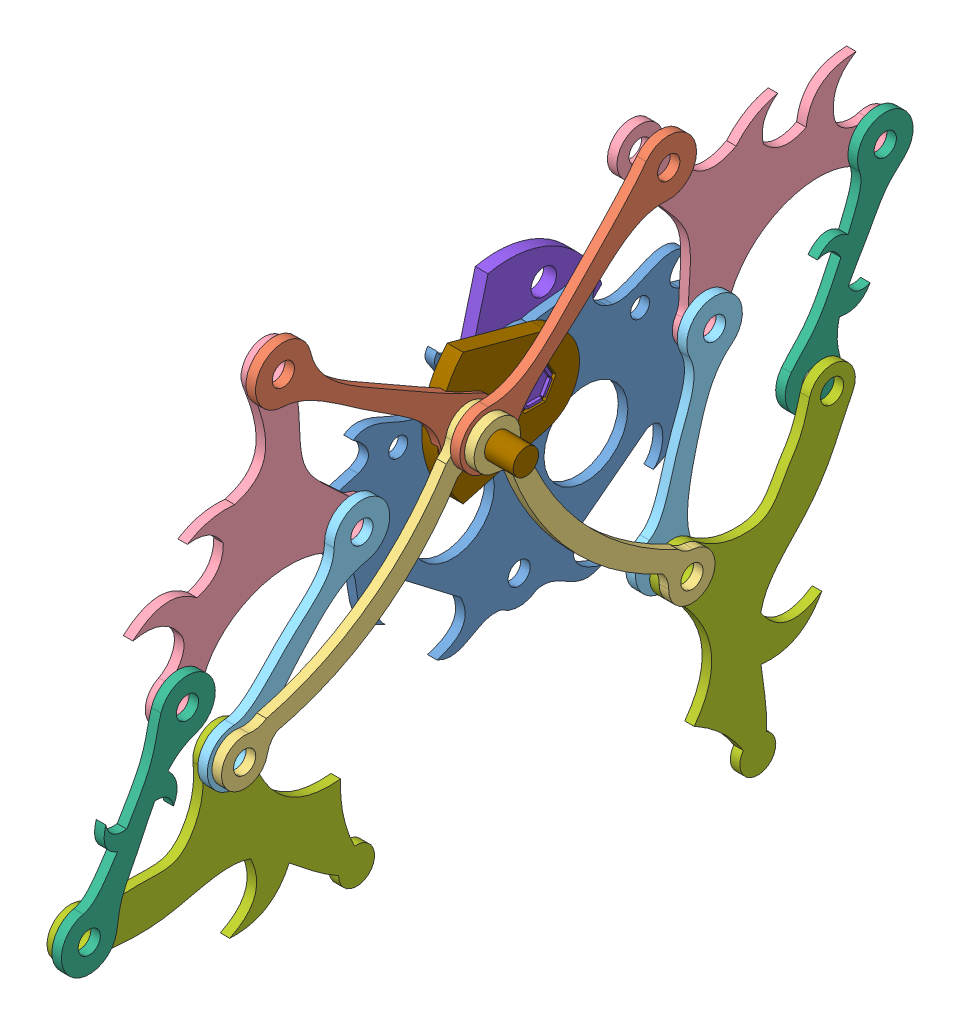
SolidWorks assembly Leg Pair.SLDASM, configuration Default (file format 7000). Lengths in mm.
Overall size (31.2 211.78 291.63).
15 component instances, 11 part files, 35 mates.
Components (placement in the parent):
- Body Plasma-1: Body Plasma.SLDPRT [Default] at (-1.2178 14.3874 -0.9979) size (3 86.21 128.33)
- Top Link Plasma-1: Top Link Plasma.SLDPRT [Default] at (3.8562 19.5324 42.9639) x (1 0 0) z (0 0.111578 0.993756) size (3 54.6 80.27)
- Top Link Plasma-2: Top Link Plasma.SLDPRT [Default] at (9.8562 49.7033 -38.2362) x (1 0 0) z (0 -0.935441 0.353482) size (3 54.6 80.27)
- Bottom Link Right Plasma-1: Bottom Link Right Plasma.SLDPRT [Default] at (2.6731 -6.268 62.766) x (1 0 0) z (0 -0.343411 -0.939185) size (3 89.15 65.46)
- Bottom Link Right Plasma-2: Bottom Link Right Plasma.SLDPRT [Default] at (8.6731 -1.4984 -1.689) x (1 0 0) z (0 -0.974254 0.225451) size (3 89.15 65.46)
- Shoulder Plasma-1: Shoulder Plasma.SLDPRT [Default] at (-3.4206 41.867 32.6126) x (1 0 0) z (0 -0.575566 0.817756) size (3 73.98 82.73)
- Shoulder Plasma-2: Shoulder Plasma.SLDPRT [Default] at (5.871 19.6041 -22.8253) x (-1 0 0) z (0 0.150403 -0.988625) size (3 73.98 82.73)
- Calf Plasma-1: Calf Plasma.SLDPRT [Default] at (3.818 -25.844 46.7531) x (1 0 0) z (0 0.928855 0.370443) size (3 69.77 41)
- Calf Plasma-2: Calf Plasma.SLDPRT [Default] at (3.818 -17.4657 -82.7015) x (1 0 0) z (0 0.649911 0.760011) size (3 69.77 41)
- Shin Plasma-1: Shin Plasma.SLDPRT [Default] at (4.0934 -85.1069 89.0539) x (1 0 0) z (0 0.895203 0.445658) size (3 66.73 47.12)
- Shin Plasma-2: Shin Plasma.SLDPRT [Default] at (4.357 15.3283 -165.5657) x (-1 0 0) z (0 -0.135116 0.99083) size (3 66.73 47.12)
- Foot Plasma-1: Foot Plasma.SLDPRT [Default] at (-4.6498 5.9095 107.7496) x (1 0 0) z (0 -0.773509 0.633785) size (3 95.59 65)
- Foot Plasma-2: Foot Plasma.SLDPRT [Default] at (16.1002 -11.5563 -20.4201) x (-1 0 0) z (0 0.153148 -0.988203) size (3 95.59 65)
- 3D Crank 3-1: 3D Crank 3.SLDPRT [Default] at (-7.4748 34.7385 -5.2038) x (1 0 0) z (0 0.866025 -0.5) size (12.2 41.31 44.62)
- 3D Crank End 3-1: 3D Crank End 3.SLDPRT [Default] at (-0.2748 27.4526 -0.9973) size (24 41.31 44.62)
Mates (geometry in assembly coordinates):
- Concentric2: concentric anti-aligned: cylinder of Top Link Plasma-1 through (5.7252 71.3273 79.1223) axis (-1 0 0) radius 3.5; cylinder of Shoulder Plasma-1 through (2.7252 71.3273 79.1223) axis (1 0 0) radius 3.5
- Concentric3: concentric anti-aligned: cylinder of Shoulder Plasma-1 through (2.7252 16.0776 54.4194) axis (1 0 0) radius 3.5; cylinder of Calf Plasma-1 through (5.7252 16.0776 54.4194) axis (-1 0 0) radius 3.5
- Concentric4: concentric anti-aligned: cylinder of Shoulder Plasma-1 through (2.7252 -4.2668 109.2457) axis (1 0 0) radius 3.5; cylinder of Shin Plasma-1 through (5.7252 -4.2668 109.2457) axis (-1 0 0) radius 3.5
- Concentric5: concentric anti-aligned: cylinder of Shin Plasma-1 through (5.7252 -52.7275 140.1167) axis (-1 0 0) radius 3.5; cylinder of Foot Plasma-1 through (2.7252 -52.7275 140.1167) axis (1 0 0) radius 3.6458
- Concentric6: concentric anti-aligned: cylinder of Calf Plasma-1 through (5.7252 -25.1127 94.2702) axis (-1 0 0) radius 3.5; cylinder of Foot Plasma-1 through (2.7252 -25.1127 94.2702) axis (1 0 0) radius 3.6458
- Concentric7: concentric anti-aligned: cylinder of Body Plasma-1 through (-3.2748 16.0776 54.4194) axis (-1 0 0) radius 3.5; cylinder of Shoulder Plasma-1 through (2.7252 16.0776 54.4194) axis (1 0 0) radius 3.5
- Concentric10: concentric aligned: cylinder of Bottom Link Right Plasma-1 through (8.7252 -25.1127 94.2702) axis (1 0 0) radius 3.5; cylinder of Foot Plasma-1 through (2.7252 -25.1127 94.2702) axis (1 0 0) radius 3.6458
- Concentric11: concentric aligned: cylinder of Top Link Plasma-1 through (2.7252 27.4526 20.8827) axis (1 0 0) radius 3.5; cylinder of Bottom Link Right Plasma-1 through (8.7252 27.4526 20.8827) axis (1 0 0) radius 3.5
- Coincident1: coincident anti-aligned: plane of Body Plasma-1 through (-0.2748 16.0776 -0.9973) normal (1 0 0); plane of Shoulder Plasma-1 through (-0.2748 47.9735 9.1021) normal (-1 0 0)
- Coincident2: coincident anti-aligned: plane of Shoulder Plasma-1 through (2.7252 47.9735 9.1021) normal (1 0 0); plane of Calf Plasma-1 through (2.7252 -35.3965 33.8907) normal (-1 0 0)
- Coincident3: coincident anti-aligned: plane of Shoulder Plasma-1 through (2.7252 47.9735 9.1021) normal (1 0 0); plane of Shin Plasma-1 through (2.7252 -111.1433 72.7055) normal (-1 0 0)
- Coincident4: coincident anti-aligned: plane of Top Link Plasma-1 through (2.7252 7.4102 42.2058) normal (-1 0 0); plane of Shoulder Plasma-1 through (2.7252 47.9735 9.1021) normal (1 0 0)
- Coincident5: coincident anti-aligned: plane of Calf Plasma-1 through (2.7252 -35.3965 33.8907) normal (-1 0 0); plane of Foot Plasma-1 through (2.7252 32.7077 114.4748) normal (1 0 0)
- Coincident6: coincident anti-aligned: plane of Bottom Link Right Plasma-1 through (5.7252 -10.6812 68.8124) normal (-1 0 0); plane of Calf Plasma-1 through (5.7252 -35.3965 33.8907) normal (1 0 0)
- Concentric12: concentric aligned: cylinder of Body Plasma-1 through (-3.2748 16.0776 -56.4139) axis (-1 0 0) radius 3.5; cylinder of Shoulder Plasma-2 through (-0.2748 16.0776 -56.4139) axis (-1 0 0) radius 3.5
- Coincident7: coincident anti-aligned: plane of Body Plasma-1 through (-0.2748 16.0776 -0.9973) normal (1 0 0); plane of Shoulder Plasma-2 through (-0.2748 7.7427 -1.6276) normal (-1 0 0)
- Concentric13: concentric aligned: cylinder of Shoulder Plasma-2 through (-0.2748 16.0776 -56.4139) axis (-1 0 0) radius 3.5; cylinder of Calf Plasma-2 through (5.7252 16.0776 -56.4139) axis (-1 0 0) radius 3.5
- Coincident8: coincident anti-aligned: plane of Shoulder Plasma-2 through (2.7252 7.7427 -1.6276) normal (1 0 0); plane of Calf Plasma-2 through (2.7252 -19.9383 -98.5312) normal (-1 0 0)
- Concentric14: concentric anti-aligned: cylinder of Shoulder Plasma-2 through (-0.2748 39.3317 -110.0708) axis (-1 0 0) radius 3.5; cylinder of Shin Plasma-2 through (2.7252 39.3317 -110.0708) axis (1 0 0) radius 3.5
- Coincident9: coincident anti-aligned: plane of Shoulder Plasma-2 through (2.7252 7.7427 -1.6276) normal (1 0 0); plane of Shin Plasma-2 through (2.7252 16.458 -196.2884) normal (-1 0 0)
- Concentric15: concentric aligned: cylinder of Calf Plasma-2 through (5.7252 -38.9226 -40.2986) axis (-1 0 0) radius 3.5; cylinder of Foot Plasma-2 through (8.7252 -38.9226 -40.2986) axis (-1 0 0) radius 3.6458
- Concentric16: concentric anti-aligned: cylinder of Shin Plasma-2 through (2.7252 -13.4523 -87.3703) axis (1 0 0) radius 3.5; cylinder of Foot Plasma-2 through (8.7252 -13.4523 -87.3703) axis (-1 0 0) radius 3.6458
- Concentric17: concentric anti-aligned: cylinder of Top Link Plasma-2 through (11.7252 27.4526 20.8827) axis (-1 0 0) radius 3.5; cylinder of Bottom Link Right Plasma-2 through (14.7252 27.4526 20.8827) axis (1 0 0) radius 3.5
- Concentric18: concentric anti-aligned: cylinder of Top Link Plasma-2 through (8.7252 73.0563 -36.0131) axis (1 0 0) radius 3.5; cylinder of Shoulder Plasma-2 through (-0.2748 73.0563 -36.0131) axis (-1 0 0) radius 3.5
- Concentric19: concentric anti-aligned: cylinder of Bottom Link Right Plasma-2 through (14.7252 -38.9226 -40.2986) axis (1 0 0) radius 3.5; cylinder of Calf Plasma-2 through (5.7252 -38.9226 -40.2986) axis (-1 0 0) radius 3.5
- Coincident14: coincident anti-aligned: plane of Top Link Plasma-2 through (8.7252 47.4449 -50.1703) normal (-1 0 0); plane of Bottom Link Right Plasma-1 through (8.7252 -10.6812 68.8124) normal (1 0 0)
- Concentric20: concentric anti-aligned: cylinder of Top Link Plasma-2 through (11.7252 27.4526 20.8827) axis (-1 0 0) radius 3.5; cylinder of Bottom Link Right Plasma-1 through (8.7252 27.4526 20.8827) axis (1 0 0) radius 3.5
- Coincident15: coincident anti-aligned: plane of Bottom Link Right Plasma-2 through (11.7252 3.9602 3.4335) normal (-1 0 0); plane of Foot Plasma-2 through (11.7252 7.8466 -0.7502) normal (1 0 0)
- Coincident16: coincident anti-aligned: plane of Top Link Plasma-2 through (11.7252 47.4449 -50.1703) normal (1 0 0); plane of Bottom Link Right Plasma-2 through (11.7252 3.9602 3.4335) normal (-1 0 0)
- Concentric21: concentric anti-aligned: cylinder of Body Plasma-1 through (-3.2748 27.4526 -0.9973) axis (1 0 0) radius 5.9792; cylinder of 3D Crank End 3-1 through (4.7252 27.4526 -0.9973) axis (-1 0 0) radius 14
- Coincident17: coincident anti-aligned: plane of Body Plasma-1 through (-0.2748 16.0776 -0.9973) normal (1 0 0); plane of 3D Crank End 3-1 through (-0.2748 27.4526 -0.9973) normal (-1 0 0)
- Concentric22: concentric anti-aligned: cylinder of Bottom Link Right Plasma-2 through (14.7252 27.4526 20.8827) axis (1 0 0) radius 3.5; cylinder of 3D Crank End 3-1 through (23.7252 27.4526 20.8827) axis (-1 0 0) radius 4
- Concentric23: concentric: cylinder of 3D Crank 3-1 through (-3.4748 27.4526 -0.9973) axis (-1 0 0) radius 14; cylinder of 3D Crank End 3-1 through (4.7252 27.4526 -0.9973) axis (-1 0 0) radius 14
- Coincident18: coincident: plane of 3D Crank 3-1 through (-0.2748 27.4526 -0.9973) normal (1 0 0); plane of 3D Crank End 3-1 through (-0.2748 27.4526 -0.9973) normal (-1 0 0)
- Parallel1: parallel anti-aligned: plane of 3D Crank 3-1 through (3.7252 32.6476 -3.9966) normal (0 1 0); plane of 3D Crank End 3-1 through (4.7252 32.6487 -0.9973) normal (0 -1 0)
